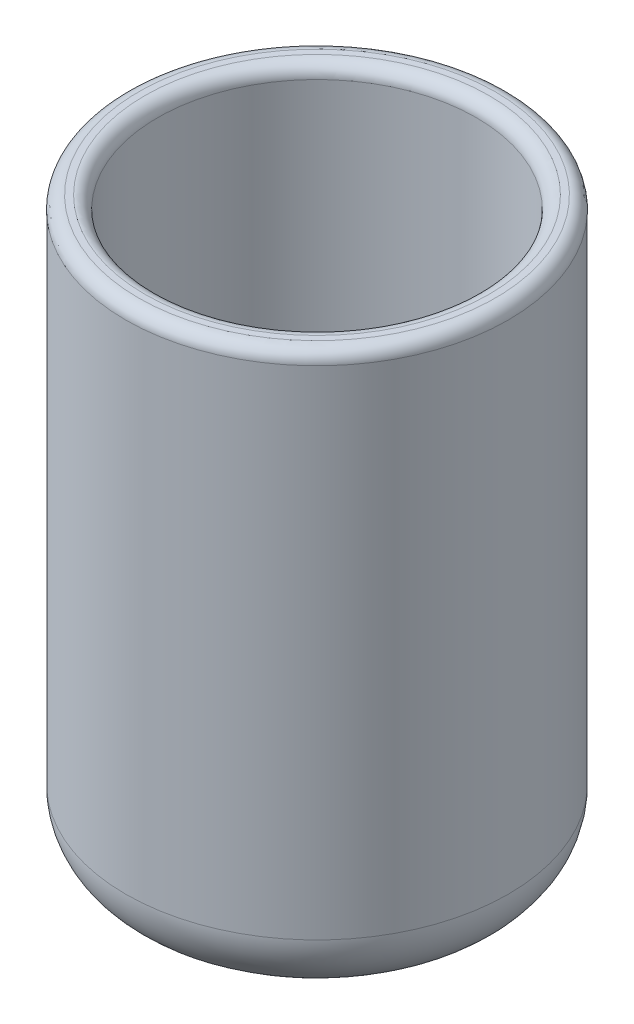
ISO-10303-21;
HEADER;
FILE_DESCRIPTION(('STEP AP214'),'2;1');
FILE_NAME('part.step','',(''),(''),'','','');
FILE_SCHEMA(('AUTOMOTIVE_DESIGN { 1 0 10303 214 1 1 1 1 }'));
ENDSEC;
DATA;
#1=APPLICATION_CONTEXT('core data for automotive mechanical design processes');
#2=APPLICATION_PROTOCOL_DEFINITION('international standard','automotive_design',2000,#1);
#3=PRODUCT_CONTEXT('',#1,'mechanical');
#4=PRODUCT('Part','Part','',(#3));
#5=PRODUCT_RELATED_PRODUCT_CATEGORY('part','',(#4));
#6=PRODUCT_DEFINITION_FORMATION('','',#4);
#7=PRODUCT_DEFINITION_CONTEXT('part definition',#1,'design');
#8=PRODUCT_DEFINITION('design','',#6,#7);
#9=PRODUCT_DEFINITION_SHAPE('','',#8);
#10=(LENGTH_UNIT() NAMED_UNIT(*) SI_UNIT(.MILLI.,.METRE.));
#11=(NAMED_UNIT(*) PLANE_ANGLE_UNIT() SI_UNIT($,.RADIAN.));
#12=(NAMED_UNIT(*) SI_UNIT($,.STERADIAN.) SOLID_ANGLE_UNIT());
#13=UNCERTAINTY_MEASURE_WITH_UNIT(LENGTH_MEASURE(1.E-05),#10,'distance_accuracy_value','');
#14=(GEOMETRIC_REPRESENTATION_CONTEXT(3) GLOBAL_UNCERTAINTY_ASSIGNED_CONTEXT((#13)) GLOBAL_UNIT_ASSIGNED_CONTEXT((#10,
#11,#12)) REPRESENTATION_CONTEXT('',''));
#15=CARTESIAN_POINT('',(0.,0.,0.));
#16=DIRECTION('',(0.,0.,1.));
#17=DIRECTION('',(1.,0.,0.));
#18=AXIS2_PLACEMENT_3D('',#15,#16,#17);
#19=CARTESIAN_POINT('',(0.,114.3,0.));
#20=DIRECTION('',(0.,-1.,0.));
#21=DIRECTION('',(0.,0.,-1.));
#22=AXIS2_PLACEMENT_3D('',#19,#20,#21);
#23=CYLINDRICAL_SURFACE('',#22,38.1);
#24=CARTESIAN_POINT('',(0.,111.76,0.));
#25=DIRECTION('',(0.,1.,0.));
#26=DIRECTION('',(0.,0.,1.));
#27=AXIS2_PLACEMENT_3D('',#24,#25,#26);
#28=CIRCLE('',#27,38.1);
#29=CARTESIAN_POINT('',(0.,111.76,38.1));
#30=VERTEX_POINT('',#29);
#31=EDGE_CURVE('E10',#30,#30,#28,.F.);
#32=ORIENTED_EDGE('',*,*,#31,.T.);
#33=EDGE_LOOP('',(#32));
#34=FACE_BOUND('',#33,.T.);
#35=CARTESIAN_POINT('',(0.,12.7,0.));
#36=DIRECTION('',(0.,1.,0.));
#37=DIRECTION('',(0.,0.,1.));
#38=AXIS2_PLACEMENT_3D('',#35,#36,#37);
#39=CIRCLE('',#38,38.1);
#40=CARTESIAN_POINT('',(0.,12.7,38.1));
#41=VERTEX_POINT('',#40);
#42=EDGE_CURVE('E60',#41,#41,#39,.T.);
#43=ORIENTED_EDGE('',*,*,#42,.T.);
#44=EDGE_LOOP('',(#43));
#45=FACE_BOUND('',#44,.T.);
#46=ADVANCED_FACE('F37',(#34,#45),#23,.T.);
#47=CARTESIAN_POINT('',(0.,114.3,0.));
#48=DIRECTION('',(0.,1.,0.));
#49=DIRECTION('',(0.,0.,1.));
#50=AXIS2_PLACEMENT_3D('',#47,#48,#49);
#51=PLANE('',#50);
#52=CARTESIAN_POINT('',(0.,114.3,0.));
#53=DIRECTION('',(0.,1.,0.));
#54=DIRECTION('',(0.,0.,1.));
#55=AXIS2_PLACEMENT_3D('',#52,#53,#54);
#56=CIRCLE('',#55,34.29);
#57=CARTESIAN_POINT('',(0.,114.3,34.29));
#58=VERTEX_POINT('',#57);
#59=EDGE_CURVE('E44',#58,#58,#56,.F.);
#60=ORIENTED_EDGE('',*,*,#59,.T.);
#61=EDGE_LOOP('',(#60));
#62=FACE_BOUND('',#61,.T.);
#63=CARTESIAN_POINT('',(0.,114.3,0.));
#64=DIRECTION('',(0.,1.,0.));
#65=DIRECTION('',(0.,0.,1.));
#66=AXIS2_PLACEMENT_3D('',#63,#64,#65);
#67=CIRCLE('',#66,35.56);
#68=CARTESIAN_POINT('',(0.,114.3,35.56));
#69=VERTEX_POINT('',#68);
#70=EDGE_CURVE('E48',#69,#69,#67,.T.);
#71=ORIENTED_EDGE('',*,*,#70,.T.);
#72=EDGE_LOOP('',(#71));
#73=FACE_BOUND('',#72,.T.);
#74=ADVANCED_FACE('F90',(#62,#73),#51,.T.);
#75=CARTESIAN_POINT('',(0.,0.,0.));
#76=DIRECTION('',(0.,1.,0.));
#77=DIRECTION('',(0.,0.,1.));
#78=AXIS2_PLACEMENT_3D('',#75,#76,#77);
#79=PLANE('',#78);
#80=CARTESIAN_POINT('',(0.,0.,0.));
#81=DIRECTION('',(0.,1.,0.));
#82=DIRECTION('',(0.,0.,1.));
#83=AXIS2_PLACEMENT_3D('',#80,#81,#82);
#84=CIRCLE('',#83,25.4);
#85=CARTESIAN_POINT('',(0.,0.,25.4));
#86=VERTEX_POINT('',#85);
#87=EDGE_CURVE('E57',#86,#86,#84,.F.);
#88=ORIENTED_EDGE('',*,*,#87,.T.);
#89=EDGE_LOOP('',(#88));
#90=FACE_BOUND('',#89,.T.);
#91=ADVANCED_FACE('F86',(#90),#79,.F.);
#92=CARTESIAN_POINT('',(0.,12.7,0.));
#93=DIRECTION('',(0.,1.,0.));
#94=DIRECTION('',(0.,0.,1.));
#95=AXIS2_PLACEMENT_3D('',#92,#93,#94);
#96=TOROIDAL_SURFACE('',#95,25.4,12.7);
#97=ORIENTED_EDGE('',*,*,#87,.F.);
#98=EDGE_LOOP('',(#97));
#99=FACE_BOUND('',#98,.T.);
#100=ORIENTED_EDGE('',*,*,#42,.F.);
#101=EDGE_LOOP('',(#100));
#102=FACE_BOUND('',#101,.T.);
#103=ADVANCED_FACE('F75',(#99,#102),#96,.T.);
#104=CARTESIAN_POINT('',(0.,114.3,0.));
#105=DIRECTION('',(0.,-1.,0.));
#106=DIRECTION('',(0.,0.,-1.));
#107=AXIS2_PLACEMENT_3D('',#104,#105,#106);
#108=CYLINDRICAL_SURFACE('',#107,31.75);
#109=CARTESIAN_POINT('',(0.,111.76,0.));
#110=DIRECTION('',(0.,1.,0.));
#111=DIRECTION('',(0.,0.,1.));
#112=AXIS2_PLACEMENT_3D('',#109,#110,#111);
#113=CIRCLE('',#112,31.75);
#114=CARTESIAN_POINT('',(0.,111.76,31.75));
#115=VERTEX_POINT('',#114);
#116=EDGE_CURVE('E52',#115,#115,#113,.T.);
#117=ORIENTED_EDGE('',*,*,#116,.T.);
#118=EDGE_LOOP('',(#117));
#119=FACE_BOUND('',#118,.T.);
#120=CARTESIAN_POINT('',(0.,12.7,0.));
#121=DIRECTION('',(0.,-1.,0.));
#122=DIRECTION('',(0.,0.,-1.));
#123=AXIS2_PLACEMENT_3D('',#120,#121,#122);
#124=CIRCLE('',#123,31.75);
#125=CARTESIAN_POINT('',(0.,12.7,-31.75));
#126=VERTEX_POINT('',#125);
#127=EDGE_CURVE('E66',#126,#126,#124,.F.);
#128=ORIENTED_EDGE('',*,*,#127,.F.);
#129=EDGE_LOOP('',(#128));
#130=FACE_BOUND('',#129,.T.);
#131=ADVANCED_FACE('F72',(#119,#130),#108,.F.);
#132=CARTESIAN_POINT('',(0.,6.35,0.));
#133=DIRECTION('',(0.,1.,0.));
#134=DIRECTION('',(0.,0.,1.));
#135=AXIS2_PLACEMENT_3D('',#132,#133,#134);
#136=PLANE('',#135);
#137=CARTESIAN_POINT('',(0.,6.35,0.));
#138=DIRECTION('',(0.,1.,0.));
#139=DIRECTION('',(0.,0.,1.));
#140=AXIS2_PLACEMENT_3D('',#137,#138,#139);
#141=CIRCLE('',#140,25.4);
#142=CARTESIAN_POINT('',(0.,6.35,25.4));
#143=VERTEX_POINT('',#142);
#144=EDGE_CURVE('E63',#143,#143,#141,.F.);
#145=ORIENTED_EDGE('',*,*,#144,.F.);
#146=EDGE_LOOP('',(#145));
#147=FACE_BOUND('',#146,.T.);
#148=ADVANCED_FACE('F74',(#147),#136,.T.);
#149=CARTESIAN_POINT('',(0.,12.7,0.));
#150=DIRECTION('',(0.,1.,0.));
#151=DIRECTION('',(0.,0.,1.));
#152=AXIS2_PLACEMENT_3D('',#149,#150,#151);
#153=TOROIDAL_SURFACE('',#152,25.4,6.35);
#154=ORIENTED_EDGE('',*,*,#144,.T.);
#155=EDGE_LOOP('',(#154));
#156=FACE_BOUND('',#155,.T.);
#157=ORIENTED_EDGE('',*,*,#127,.T.);
#158=EDGE_LOOP('',(#157));
#159=FACE_BOUND('',#158,.T.);
#160=ADVANCED_FACE('F70',(#156,#159),#153,.F.);
#161=CARTESIAN_POINT('',(0.,111.76,0.));
#162=DIRECTION('',(0.,1.,0.));
#163=DIRECTION('',(0.,0.,1.));
#164=AXIS2_PLACEMENT_3D('',#161,#162,#163);
#165=TOROIDAL_SURFACE('',#164,34.29,2.54);
#166=ORIENTED_EDGE('',*,*,#59,.F.);
#167=EDGE_LOOP('',(#166));
#168=FACE_BOUND('',#167,.T.);
#169=ORIENTED_EDGE('',*,*,#116,.F.);
#170=EDGE_LOOP('',(#169));
#171=FACE_BOUND('',#170,.T.);
#172=ADVANCED_FACE('F98',(#168,#171),#165,.T.);
#173=CARTESIAN_POINT('',(0.,111.76,0.));
#174=DIRECTION('',(0.,1.,0.));
#175=DIRECTION('',(0.,0.,1.));
#176=AXIS2_PLACEMENT_3D('',#173,#174,#175);
#177=TOROIDAL_SURFACE('',#176,35.56,2.54);
#178=ORIENTED_EDGE('',*,*,#31,.F.);
#179=EDGE_LOOP('',(#178));
#180=FACE_BOUND('',#179,.T.);
#181=ORIENTED_EDGE('',*,*,#70,.F.);
#182=EDGE_LOOP('',(#181));
#183=FACE_BOUND('',#182,.T.);
#184=ADVANCED_FACE('F39',(#180,#183),#177,.T.);
#185=CLOSED_SHELL('',(#46,#74,#91,#103,#131,#148,#160,#172,#184));
#186=MANIFOLD_SOLID_BREP('B2',#185);
#187=ADVANCED_BREP_SHAPE_REPRESENTATION('',(#18,#186),#14);
#188=SHAPE_DEFINITION_REPRESENTATION(#9,#187);
ENDSEC;
END-ISO-10303-21;
